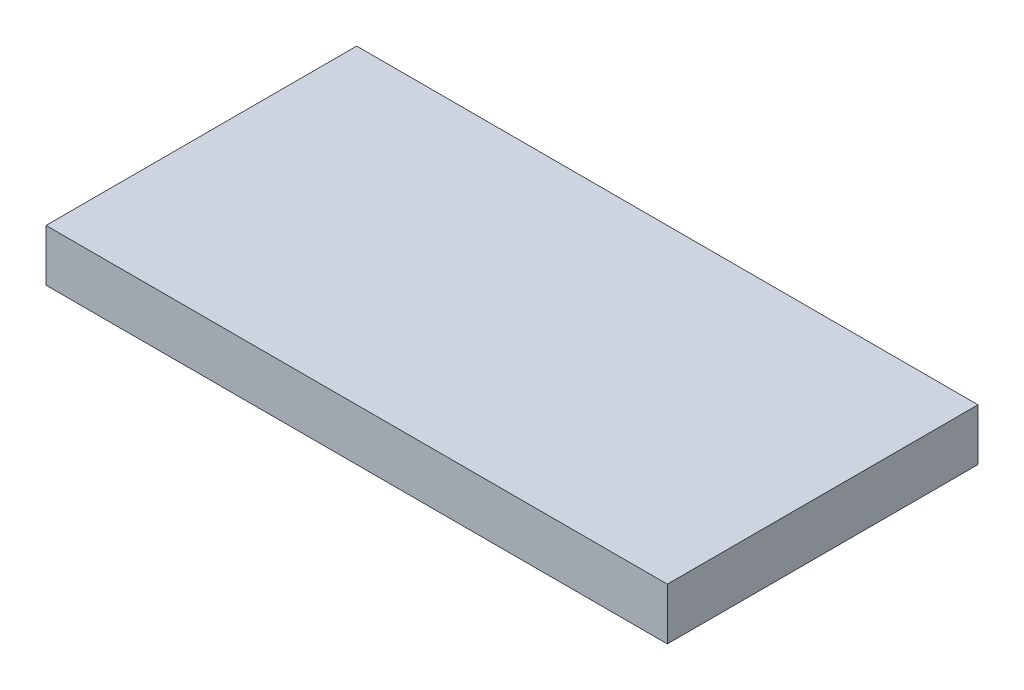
ISO-10303-21;
HEADER;
FILE_DESCRIPTION(('STEP AP214'),'2;1');
FILE_NAME('part.step','',(''),(''),'','','');
FILE_SCHEMA(('AUTOMOTIVE_DESIGN { 1 0 10303 214 1 1 1 1 }'));
ENDSEC;
DATA;
#1=APPLICATION_CONTEXT('core data for automotive mechanical design processes');
#2=APPLICATION_PROTOCOL_DEFINITION('international standard','automotive_design',2000,#1);
#3=PRODUCT_CONTEXT('',#1,'mechanical');
#4=PRODUCT('Part','Part','',(#3));
#5=PRODUCT_RELATED_PRODUCT_CATEGORY('part','',(#4));
#6=PRODUCT_DEFINITION_FORMATION('','',#4);
#7=PRODUCT_DEFINITION_CONTEXT('part definition',#1,'design');
#8=PRODUCT_DEFINITION('design','',#6,#7);
#9=PRODUCT_DEFINITION_SHAPE('','',#8);
#10=(LENGTH_UNIT() NAMED_UNIT(*) SI_UNIT(.MILLI.,.METRE.));
#11=(NAMED_UNIT(*) PLANE_ANGLE_UNIT() SI_UNIT($,.RADIAN.));
#12=(NAMED_UNIT(*) SI_UNIT($,.STERADIAN.) SOLID_ANGLE_UNIT());
#13=UNCERTAINTY_MEASURE_WITH_UNIT(LENGTH_MEASURE(1.E-05),#10,'distance_accuracy_value','');
#14=(GEOMETRIC_REPRESENTATION_CONTEXT(3) GLOBAL_UNCERTAINTY_ASSIGNED_CONTEXT((#13)) GLOBAL_UNIT_ASSIGNED_CONTEXT((#10,
#11,#12)) REPRESENTATION_CONTEXT('',''));
#15=CARTESIAN_POINT('',(0.,0.,0.));
#16=DIRECTION('',(0.,0.,1.));
#17=DIRECTION('',(1.,0.,0.));
#18=AXIS2_PLACEMENT_3D('',#15,#16,#17);
#19=CARTESIAN_POINT('',(0.,12.7,0.));
#20=DIRECTION('',(1.,0.,0.));
#21=DIRECTION('',(0.,0.,-1.));
#22=AXIS2_PLACEMENT_3D('',#19,#20,#21);
#23=PLANE('',#22);
#24=DIRECTION('',(0.,0.,1.));
#25=VECTOR('',#24,1.);
#26=CARTESIAN_POINT('',(0.,0.,0.));
#27=LINE('',#26,#25);
#28=CARTESIAN_POINT('',(0.,0.,-76.2));
#29=VERTEX_POINT('',#28);
#30=CARTESIAN_POINT('',(0.,0.,0.));
#31=VERTEX_POINT('',#30);
#32=EDGE_CURVE('E96',#29,#31,#27,.T.);
#33=ORIENTED_EDGE('',*,*,#32,.T.);
#34=DIRECTION('',(0.,-1.,0.));
#35=VECTOR('',#34,1.);
#36=CARTESIAN_POINT('',(0.,12.7,0.));
#37=LINE('',#36,#35);
#38=CARTESIAN_POINT('',(0.,12.7,0.));
#39=VERTEX_POINT('',#38);
#40=EDGE_CURVE('E11',#39,#31,#37,.T.);
#41=ORIENTED_EDGE('',*,*,#40,.F.);
#42=DIRECTION('',(0.,0.,1.));
#43=VECTOR('',#42,1.);
#44=CARTESIAN_POINT('',(0.,12.7,0.));
#45=LINE('',#44,#43);
#46=CARTESIAN_POINT('',(0.,12.7,-76.2));
#47=VERTEX_POINT('',#46);
#48=EDGE_CURVE('E84',#47,#39,#45,.T.);
#49=ORIENTED_EDGE('',*,*,#48,.F.);
#50=DIRECTION('',(0.,-1.,0.));
#51=VECTOR('',#50,1.);
#52=CARTESIAN_POINT('',(0.,12.7,-76.2));
#53=LINE('',#52,#51);
#54=EDGE_CURVE('E92',#47,#29,#53,.T.);
#55=ORIENTED_EDGE('',*,*,#54,.T.);
#56=EDGE_LOOP('',(#33,#41,#49,#55));
#57=FACE_BOUND('',#56,.T.);
#58=ADVANCED_FACE('F33',(#57),#23,.F.);
#59=CARTESIAN_POINT('',(0.,12.7,0.));
#60=DIRECTION('',(0.,0.,-1.));
#61=DIRECTION('',(-1.,0.,0.));
#62=AXIS2_PLACEMENT_3D('',#59,#60,#61);
#63=PLANE('',#62);
#64=DIRECTION('',(1.,0.,0.));
#65=VECTOR('',#64,1.);
#66=CARTESIAN_POINT('',(0.,0.,0.));
#67=LINE('',#66,#65);
#68=CARTESIAN_POINT('',(152.4,0.,0.));
#69=VERTEX_POINT('',#68);
#70=EDGE_CURVE('E88',#31,#69,#67,.T.);
#71=ORIENTED_EDGE('',*,*,#70,.T.);
#72=DIRECTION('',(0.,-1.,0.));
#73=VECTOR('',#72,1.);
#74=CARTESIAN_POINT('',(152.4,12.7,0.));
#75=LINE('',#74,#73);
#76=CARTESIAN_POINT('',(152.4,12.7,0.));
#77=VERTEX_POINT('',#76);
#78=EDGE_CURVE('E41',#77,#69,#75,.T.);
#79=ORIENTED_EDGE('',*,*,#78,.F.);
#80=DIRECTION('',(1.,0.,0.));
#81=VECTOR('',#80,1.);
#82=CARTESIAN_POINT('',(0.,12.7,0.));
#83=LINE('',#82,#81);
#84=EDGE_CURVE('E79',#39,#77,#83,.T.);
#85=ORIENTED_EDGE('',*,*,#84,.F.);
#86=ORIENTED_EDGE('',*,*,#40,.T.);
#87=EDGE_LOOP('',(#71,#79,#85,#86));
#88=FACE_BOUND('',#87,.T.);
#89=ADVANCED_FACE('F87',(#88),#63,.F.);
#90=CARTESIAN_POINT('',(152.4,12.7,0.));
#91=DIRECTION('',(-1.,0.,0.));
#92=DIRECTION('',(0.,0.,1.));
#93=AXIS2_PLACEMENT_3D('',#90,#91,#92);
#94=PLANE('',#93);
#95=DIRECTION('',(0.,0.,-1.));
#96=VECTOR('',#95,1.);
#97=CARTESIAN_POINT('',(152.4,0.,0.));
#98=LINE('',#97,#96);
#99=CARTESIAN_POINT('',(152.4,0.,-76.2));
#100=VERTEX_POINT('',#99);
#101=EDGE_CURVE('E66',#69,#100,#98,.T.);
#102=ORIENTED_EDGE('',*,*,#101,.T.);
#103=DIRECTION('',(0.,-1.,0.));
#104=VECTOR('',#103,1.);
#105=CARTESIAN_POINT('',(152.4,12.7,-76.2));
#106=LINE('',#105,#104);
#107=CARTESIAN_POINT('',(152.4,12.7,-76.2));
#108=VERTEX_POINT('',#107);
#109=EDGE_CURVE('E89',#108,#100,#106,.T.);
#110=ORIENTED_EDGE('',*,*,#109,.F.);
#111=DIRECTION('',(0.,0.,-1.));
#112=VECTOR('',#111,1.);
#113=CARTESIAN_POINT('',(152.4,12.7,0.));
#114=LINE('',#113,#112);
#115=EDGE_CURVE('E82',#77,#108,#114,.T.);
#116=ORIENTED_EDGE('',*,*,#115,.F.);
#117=ORIENTED_EDGE('',*,*,#78,.T.);
#118=EDGE_LOOP('',(#102,#110,#116,#117));
#119=FACE_BOUND('',#118,.T.);
#120=ADVANCED_FACE('F90',(#119),#94,.F.);
#121=CARTESIAN_POINT('',(0.,12.7,-76.2));
#122=DIRECTION('',(0.,0.,1.));
#123=DIRECTION('',(1.,0.,0.));
#124=AXIS2_PLACEMENT_3D('',#121,#122,#123);
#125=PLANE('',#124);
#126=DIRECTION('',(-1.,0.,0.));
#127=VECTOR('',#126,1.);
#128=CARTESIAN_POINT('',(0.,0.,-76.2));
#129=LINE('',#128,#127);
#130=EDGE_CURVE('E72',#100,#29,#129,.T.);
#131=ORIENTED_EDGE('',*,*,#130,.T.);
#132=ORIENTED_EDGE('',*,*,#54,.F.);
#133=DIRECTION('',(-1.,0.,0.));
#134=VECTOR('',#133,1.);
#135=CARTESIAN_POINT('',(0.,12.7,-76.2));
#136=LINE('',#135,#134);
#137=EDGE_CURVE('E49',#108,#47,#136,.T.);
#138=ORIENTED_EDGE('',*,*,#137,.F.);
#139=ORIENTED_EDGE('',*,*,#109,.T.);
#140=EDGE_LOOP('',(#131,#132,#138,#139));
#141=FACE_BOUND('',#140,.T.);
#142=ADVANCED_FACE('F103',(#141),#125,.F.);
#143=CARTESIAN_POINT('',(0.,12.7,-76.2));
#144=DIRECTION('',(0.,-1.,0.));
#145=DIRECTION('',(0.,0.,-1.));
#146=AXIS2_PLACEMENT_3D('',#143,#144,#145);
#147=PLANE('',#146);
#148=ORIENTED_EDGE('',*,*,#48,.T.);
#149=ORIENTED_EDGE('',*,*,#84,.T.);
#150=ORIENTED_EDGE('',*,*,#115,.T.);
#151=ORIENTED_EDGE('',*,*,#137,.T.);
#152=EDGE_LOOP('',(#148,#149,#150,#151));
#153=FACE_BOUND('',#152,.T.);
#154=ADVANCED_FACE('F80',(#153),#147,.F.);
#155=CARTESIAN_POINT('',(0.,0.,-76.2));
#156=DIRECTION('',(0.,-1.,0.));
#157=DIRECTION('',(0.,0.,-1.));
#158=AXIS2_PLACEMENT_3D('',#155,#156,#157);
#159=PLANE('',#158);
#160=ORIENTED_EDGE('',*,*,#32,.F.);
#161=ORIENTED_EDGE('',*,*,#130,.F.);
#162=ORIENTED_EDGE('',*,*,#101,.F.);
#163=ORIENTED_EDGE('',*,*,#70,.F.);
#164=EDGE_LOOP('',(#160,#161,#162,#163));
#165=FACE_BOUND('',#164,.T.);
#166=ADVANCED_FACE('F106',(#165),#159,.T.);
#167=CLOSED_SHELL('',(#58,#89,#120,#142,#154,#166));
#168=MANIFOLD_SOLID_BREP('B2',#167);
#169=ADVANCED_BREP_SHAPE_REPRESENTATION('',(#18,#168),#14);
#170=SHAPE_DEFINITION_REPRESENTATION(#9,#169);
ENDSEC;
END-ISO-10303-21;
